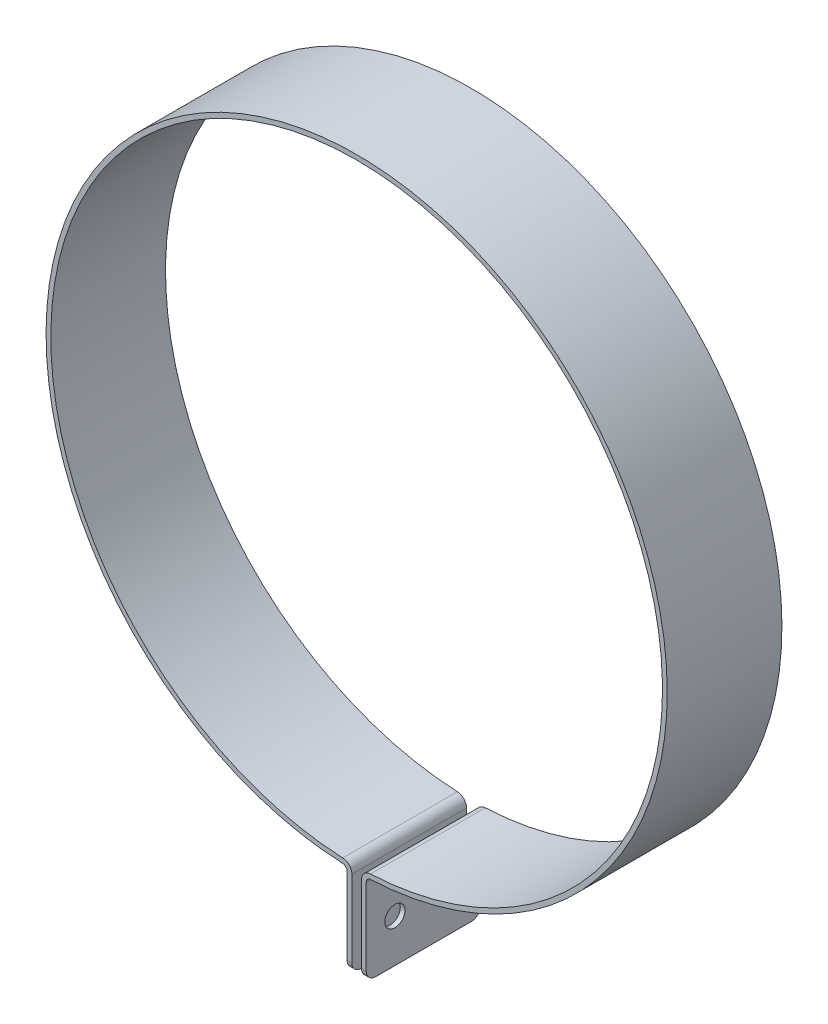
ISO-10303-21;
HEADER;
FILE_DESCRIPTION(('STEP AP214'),'2;1');
FILE_NAME('part.step','',(''),(''),'','','');
FILE_SCHEMA(('AUTOMOTIVE_DESIGN { 1 0 10303 214 1 1 1 1 }'));
ENDSEC;
DATA;
#1=APPLICATION_CONTEXT('core data for automotive mechanical design processes');
#2=APPLICATION_PROTOCOL_DEFINITION('international standard','automotive_design',2000,#1);
#3=PRODUCT_CONTEXT('',#1,'mechanical');
#4=PRODUCT('Part','Part','',(#3));
#5=PRODUCT_RELATED_PRODUCT_CATEGORY('part','',(#4));
#6=PRODUCT_DEFINITION_FORMATION('','',#4);
#7=PRODUCT_DEFINITION_CONTEXT('part definition',#1,'design');
#8=PRODUCT_DEFINITION('design','',#6,#7);
#9=PRODUCT_DEFINITION_SHAPE('','',#8);
#10=(LENGTH_UNIT() NAMED_UNIT(*) SI_UNIT(.MILLI.,.METRE.));
#11=(NAMED_UNIT(*) PLANE_ANGLE_UNIT() SI_UNIT($,.RADIAN.));
#12=(NAMED_UNIT(*) SI_UNIT($,.STERADIAN.) SOLID_ANGLE_UNIT());
#13=UNCERTAINTY_MEASURE_WITH_UNIT(LENGTH_MEASURE(1.E-05),#10,'distance_accuracy_value','');
#14=(GEOMETRIC_REPRESENTATION_CONTEXT(3) GLOBAL_UNCERTAINTY_ASSIGNED_CONTEXT((#13)) GLOBAL_UNIT_ASSIGNED_CONTEXT((#10,
#11,#12)) REPRESENTATION_CONTEXT('',''));
#15=CARTESIAN_POINT('',(0.,0.,0.));
#16=DIRECTION('',(0.,0.,1.));
#17=DIRECTION('',(1.,0.,0.));
#18=AXIS2_PLACEMENT_3D('',#15,#16,#17);
#19=CARTESIAN_POINT('',(-3.175,-133.35,-38.1));
#20=DIRECTION('',(0.,-1.,0.));
#21=DIRECTION('',(0.,0.,-1.));
#22=AXIS2_PLACEMENT_3D('',#19,#20,#21);
#23=PLANE('',#22);
#24=DIRECTION('',(0.,0.,1.));
#25=VECTOR('',#24,1.);
#26=CARTESIAN_POINT('',(-3.175,-133.35,-38.1));
#27=LINE('',#26,#25);
#28=CARTESIAN_POINT('',(-3.175,-133.35,-34.925));
#29=VERTEX_POINT('',#28);
#30=CARTESIAN_POINT('',(-3.175,-133.35,-3.17500000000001));
#31=VERTEX_POINT('',#30);
#32=EDGE_CURVE('E284',#29,#31,#27,.T.);
#33=ORIENTED_EDGE('',*,*,#32,.F.);
#34=DIRECTION('',(1.,0.,0.));
#35=VECTOR('',#34,1.);
#36=CARTESIAN_POINT('',(-1.6002,-133.35,-34.925));
#37=LINE('',#36,#35);
#38=CARTESIAN_POINT('',(-1.6002,-133.35,-34.925));
#39=VERTEX_POINT('',#38);
#40=EDGE_CURVE('E226',#29,#39,#37,.T.);
#41=ORIENTED_EDGE('',*,*,#40,.T.);
#42=DIRECTION('',(0.,0.,-1.));
#43=VECTOR('',#42,1.);
#44=CARTESIAN_POINT('',(-1.6002,-133.35,-38.1));
#45=LINE('',#44,#43);
#46=CARTESIAN_POINT('',(-1.6002,-133.35,-3.175));
#47=VERTEX_POINT('',#46);
#48=EDGE_CURVE('E183',#47,#39,#45,.T.);
#49=ORIENTED_EDGE('',*,*,#48,.F.);
#50=DIRECTION('',(1.,0.,0.));
#51=VECTOR('',#50,1.);
#52=CARTESIAN_POINT('',(-3.175,-133.35,-3.175));
#53=LINE('',#52,#51);
#54=EDGE_CURVE('E224',#47,#31,#53,.F.);
#55=ORIENTED_EDGE('',*,*,#54,.T.);
#56=EDGE_LOOP('',(#33,#41,#49,#55));
#57=FACE_BOUND('',#56,.T.);
#58=ADVANCED_FACE('F37',(#57),#23,.T.);
#59=CARTESIAN_POINT('',(0.,0.,-38.1));
#60=DIRECTION('',(0.,0.,1.));
#61=DIRECTION('',(1.,0.,0.));
#62=AXIS2_PLACEMENT_3D('',#59,#60,#61);
#63=CYLINDRICAL_SURFACE('',#62,103.1748);
#64=CARTESIAN_POINT('',(0.,0.,-38.1));
#65=DIRECTION('',(0.,0.,1.));
#66=DIRECTION('',(1.,0.,0.));
#67=AXIS2_PLACEMENT_3D('',#64,#65,#66);
#68=CIRCLE('',#67,103.1748);
#69=CARTESIAN_POINT('',(4.67839175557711,-103.068676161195,-38.1));
#70=VERTEX_POINT('',#69);
#71=CARTESIAN_POINT('',(-4.67839175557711,-103.068676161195,-38.1));
#72=VERTEX_POINT('',#71);
#73=EDGE_CURVE('E296',#70,#72,#68,.T.);
#74=ORIENTED_EDGE('',*,*,#73,.T.);
#75=DIRECTION('',(0.,0.,1.));
#76=VECTOR('',#75,1.);
#77=CARTESIAN_POINT('',(-4.67839175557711,-103.068676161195,-38.1));
#78=LINE('',#77,#76);
#79=CARTESIAN_POINT('',(-4.67839175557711,-103.068676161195,0.));
#80=VERTEX_POINT('',#79);
#81=EDGE_CURVE('E185',#72,#80,#78,.T.);
#82=ORIENTED_EDGE('',*,*,#81,.T.);
#83=CARTESIAN_POINT('',(0.,0.,0.));
#84=DIRECTION('',(0.,0.,1.));
#85=DIRECTION('',(1.,0.,0.));
#86=AXIS2_PLACEMENT_3D('',#83,#84,#85);
#87=CIRCLE('',#86,103.1748);
#88=CARTESIAN_POINT('',(4.67839175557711,-103.068676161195,0.));
#89=VERTEX_POINT('',#88);
#90=EDGE_CURVE('E162',#89,#80,#87,.T.);
#91=ORIENTED_EDGE('',*,*,#90,.F.);
#92=DIRECTION('',(0.,0.,1.));
#93=VECTOR('',#92,1.);
#94=CARTESIAN_POINT('',(4.67839175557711,-103.068676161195,-38.1));
#95=LINE('',#94,#93);
#96=EDGE_CURVE('E182',#89,#70,#95,.F.);
#97=ORIENTED_EDGE('',*,*,#96,.T.);
#98=EDGE_LOOP('',(#74,#82,#91,#97));
#99=FACE_BOUND('',#98,.T.);
#100=ADVANCED_FACE('F325',(#99),#63,.T.);
#101=CARTESIAN_POINT('',(0.,0.,-38.1));
#102=DIRECTION('',(0.,0.,1.));
#103=DIRECTION('',(1.,0.,0.));
#104=AXIS2_PLACEMENT_3D('',#101,#102,#103);
#105=PLANE('',#104);
#106=DIRECTION('',(0.,1.,0.));
#107=VECTOR('',#106,1.);
#108=CARTESIAN_POINT('',(3.175,-133.35,-38.1));
#109=LINE('',#108,#107);
#110=CARTESIAN_POINT('',(3.175,-130.175,-38.1));
#111=VERTEX_POINT('',#110);
#112=CARTESIAN_POINT('',(3.175,-104.641856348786,-38.1));
#113=VERTEX_POINT('',#112);
#114=EDGE_CURVE('E283',#111,#113,#109,.T.);
#115=ORIENTED_EDGE('',*,*,#114,.F.);
#116=DIRECTION('',(1.,0.,0.));
#117=VECTOR('',#116,1.);
#118=CARTESIAN_POINT('',(1.6002,-130.175,-38.1));
#119=LINE('',#118,#117);
#120=CARTESIAN_POINT('',(1.6002,-130.175,-38.1));
#121=VERTEX_POINT('',#120);
#122=EDGE_CURVE('E216',#111,#121,#119,.F.);
#123=ORIENTED_EDGE('',*,*,#122,.T.);
#124=DIRECTION('',(0.,1.,0.));
#125=VECTOR('',#124,1.);
#126=CARTESIAN_POINT('',(1.6002,-139.7,-38.1));
#127=LINE('',#126,#125);
#128=CARTESIAN_POINT('',(1.6002,-104.666126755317,-38.1));
#129=VERTEX_POINT('',#128);
#130=EDGE_CURVE('E179',#121,#129,#127,.T.);
#131=ORIENTED_EDGE('',*,*,#130,.T.);
#132=CARTESIAN_POINT('',(4.7752,-104.666126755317,-38.1));
#133=DIRECTION('',(0.,0.,1.));
#134=DIRECTION('',(1.,0.,0.));
#135=AXIS2_PLACEMENT_3D('',#132,#133,#134);
#136=CIRCLE('',#135,3.175);
#137=CARTESIAN_POINT('',(4.63049696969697,-101.494425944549,-38.1));
#138=VERTEX_POINT('',#137);
#139=EDGE_CURVE('E210',#129,#138,#136,.F.);
#140=ORIENTED_EDGE('',*,*,#139,.T.);
#141=CARTESIAN_POINT('',(0.,0.,-38.1));
#142=DIRECTION('',(0.,0.,1.));
#143=DIRECTION('',(1.,0.,0.));
#144=AXIS2_PLACEMENT_3D('',#141,#142,#143);
#145=CIRCLE('',#144,101.6);
#146=CARTESIAN_POINT('',(-4.63049696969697,-101.494425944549,-38.1));
#147=VERTEX_POINT('',#146);
#148=EDGE_CURVE('E292',#138,#147,#145,.T.);
#149=ORIENTED_EDGE('',*,*,#148,.T.);
#150=CARTESIAN_POINT('',(-4.7752,-104.666126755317,-38.1));
#151=DIRECTION('',(0.,0.,1.));
#152=DIRECTION('',(1.,0.,0.));
#153=AXIS2_PLACEMENT_3D('',#150,#151,#152);
#154=CIRCLE('',#153,3.175);
#155=CARTESIAN_POINT('',(-1.6002,-104.666126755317,-38.1));
#156=VERTEX_POINT('',#155);
#157=EDGE_CURVE('E212',#147,#156,#154,.F.);
#158=ORIENTED_EDGE('',*,*,#157,.T.);
#159=DIRECTION('',(0.,-1.,0.));
#160=VECTOR('',#159,1.);
#161=CARTESIAN_POINT('',(-1.6002,-139.7,-38.1));
#162=LINE('',#161,#160);
#163=CARTESIAN_POINT('',(-1.6002,-130.175,-38.1));
#164=VERTEX_POINT('',#163);
#165=EDGE_CURVE('E271',#156,#164,#162,.T.);
#166=ORIENTED_EDGE('',*,*,#165,.T.);
#167=DIRECTION('',(1.,0.,0.));
#168=VECTOR('',#167,1.);
#169=CARTESIAN_POINT('',(-3.175,-130.175,-38.1));
#170=LINE('',#169,#168);
#171=CARTESIAN_POINT('',(-3.175,-130.175,-38.1));
#172=VERTEX_POINT('',#171);
#173=EDGE_CURVE('E214',#164,#172,#170,.F.);
#174=ORIENTED_EDGE('',*,*,#173,.T.);
#175=DIRECTION('',(0.,-1.,0.));
#176=VECTOR('',#175,1.);
#177=CARTESIAN_POINT('',(-3.175,-133.35,-38.1));
#178=LINE('',#177,#176);
#179=CARTESIAN_POINT('',(-3.175,-104.641856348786,-38.1));
#180=VERTEX_POINT('',#179);
#181=EDGE_CURVE('E281',#180,#172,#178,.T.);
#182=ORIENTED_EDGE('',*,*,#181,.F.);
#183=CARTESIAN_POINT('',(-4.7498,-104.641856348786,-38.1));
#184=DIRECTION('',(0.,0.,1.));
#185=DIRECTION('',(1.,0.,0.));
#186=AXIS2_PLACEMENT_3D('',#183,#184,#185);
#187=CIRCLE('',#186,1.5748);
#188=EDGE_CURVE('E167',#180,#72,#187,.T.);
#189=ORIENTED_EDGE('',*,*,#188,.T.);
#190=ORIENTED_EDGE('',*,*,#73,.F.);
#191=CARTESIAN_POINT('',(4.7498,-104.641856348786,-38.1));
#192=DIRECTION('',(0.,0.,1.));
#193=DIRECTION('',(1.,0.,0.));
#194=AXIS2_PLACEMENT_3D('',#191,#192,#193);
#195=CIRCLE('',#194,1.5748);
#196=EDGE_CURVE('E198',#70,#113,#195,.T.);
#197=ORIENTED_EDGE('',*,*,#196,.T.);
#198=EDGE_LOOP('',(#115,#123,#131,#140,#149,#158,#166,#174,#182,#189,#190,#197));
#199=FACE_BOUND('',#198,.T.);
#200=ADVANCED_FACE('F328',(#199),#105,.F.);
#201=CARTESIAN_POINT('',(0.,0.,0.));
#202=DIRECTION('',(0.,0.,1.));
#203=DIRECTION('',(1.,0.,0.));
#204=AXIS2_PLACEMENT_3D('',#201,#202,#203);
#205=PLANE('',#204);
#206=DIRECTION('',(0.,-1.,0.));
#207=VECTOR('',#206,1.);
#208=CARTESIAN_POINT('',(-3.175,-133.35,0.));
#209=LINE('',#208,#207);
#210=CARTESIAN_POINT('',(-3.175,-104.641856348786,0.));
#211=VERTEX_POINT('',#210);
#212=CARTESIAN_POINT('',(-3.175,-130.175,0.));
#213=VERTEX_POINT('',#212);
#214=EDGE_CURVE('E159',#211,#213,#209,.T.);
#215=ORIENTED_EDGE('',*,*,#214,.T.);
#216=DIRECTION('',(1.,0.,0.));
#217=VECTOR('',#216,1.);
#218=CARTESIAN_POINT('',(0.,-130.175,0.));
#219=LINE('',#218,#217);
#220=CARTESIAN_POINT('',(-1.6002,-130.175,0.));
#221=VERTEX_POINT('',#220);
#222=EDGE_CURVE('E243',#213,#221,#219,.T.);
#223=ORIENTED_EDGE('',*,*,#222,.T.);
#224=DIRECTION('',(0.,-1.,0.));
#225=VECTOR('',#224,1.);
#226=CARTESIAN_POINT('',(-1.6002,-139.7,0.));
#227=LINE('',#226,#225);
#228=CARTESIAN_POINT('',(-1.6002,-104.666126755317,0.));
#229=VERTEX_POINT('',#228);
#230=EDGE_CURVE('E270',#229,#221,#227,.T.);
#231=ORIENTED_EDGE('',*,*,#230,.F.);
#232=CARTESIAN_POINT('',(-4.7752,-104.666126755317,0.));
#233=DIRECTION('',(0.,0.,1.));
#234=DIRECTION('',(1.,0.,0.));
#235=AXIS2_PLACEMENT_3D('',#232,#233,#234);
#236=CIRCLE('',#235,3.175);
#237=CARTESIAN_POINT('',(-4.63049696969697,-101.494425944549,0.));
#238=VERTEX_POINT('',#237);
#239=EDGE_CURVE('E54',#229,#238,#236,.T.);
#240=ORIENTED_EDGE('',*,*,#239,.T.);
#241=CARTESIAN_POINT('',(0.,0.,0.));
#242=DIRECTION('',(0.,0.,1.));
#243=DIRECTION('',(1.,0.,0.));
#244=AXIS2_PLACEMENT_3D('',#241,#242,#243);
#245=CIRCLE('',#244,101.6);
#246=CARTESIAN_POINT('',(4.63049696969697,-101.494425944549,0.));
#247=VERTEX_POINT('',#246);
#248=EDGE_CURVE('E290',#247,#238,#245,.T.);
#249=ORIENTED_EDGE('',*,*,#248,.F.);
#250=CARTESIAN_POINT('',(4.7752,-104.666126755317,0.));
#251=DIRECTION('',(0.,0.,1.));
#252=DIRECTION('',(1.,0.,0.));
#253=AXIS2_PLACEMENT_3D('',#250,#251,#252);
#254=CIRCLE('',#253,3.175);
#255=CARTESIAN_POINT('',(1.6002,-104.666126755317,0.));
#256=VERTEX_POINT('',#255);
#257=EDGE_CURVE('E62',#247,#256,#254,.T.);
#258=ORIENTED_EDGE('',*,*,#257,.T.);
#259=DIRECTION('',(0.,1.,0.));
#260=VECTOR('',#259,1.);
#261=CARTESIAN_POINT('',(1.6002,-139.7,0.));
#262=LINE('',#261,#260);
#263=CARTESIAN_POINT('',(1.6002,-130.175,0.));
#264=VERTEX_POINT('',#263);
#265=EDGE_CURVE('E274',#264,#256,#262,.T.);
#266=ORIENTED_EDGE('',*,*,#265,.F.);
#267=DIRECTION('',(1.,0.,0.));
#268=VECTOR('',#267,1.);
#269=CARTESIAN_POINT('',(0.,-130.175,0.));
#270=LINE('',#269,#268);
#271=CARTESIAN_POINT('',(3.175,-130.175,0.));
#272=VERTEX_POINT('',#271);
#273=EDGE_CURVE('E240',#264,#272,#270,.T.);
#274=ORIENTED_EDGE('',*,*,#273,.T.);
#275=DIRECTION('',(0.,1.,0.));
#276=VECTOR('',#275,1.);
#277=CARTESIAN_POINT('',(3.175,-133.35,0.));
#278=LINE('',#277,#276);
#279=CARTESIAN_POINT('',(3.175,-104.641856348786,0.));
#280=VERTEX_POINT('',#279);
#281=EDGE_CURVE('E178',#272,#280,#278,.T.);
#282=ORIENTED_EDGE('',*,*,#281,.T.);
#283=CARTESIAN_POINT('',(4.7498,-104.641856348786,0.));
#284=DIRECTION('',(0.,0.,1.));
#285=DIRECTION('',(1.,0.,0.));
#286=AXIS2_PLACEMENT_3D('',#283,#284,#285);
#287=CIRCLE('',#286,1.5748);
#288=EDGE_CURVE('E166',#280,#89,#287,.F.);
#289=ORIENTED_EDGE('',*,*,#288,.T.);
#290=ORIENTED_EDGE('',*,*,#90,.T.);
#291=CARTESIAN_POINT('',(-4.7498,-104.641856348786,0.));
#292=DIRECTION('',(0.,0.,1.));
#293=DIRECTION('',(1.,0.,0.));
#294=AXIS2_PLACEMENT_3D('',#291,#292,#293);
#295=CIRCLE('',#294,1.5748);
#296=EDGE_CURVE('E155',#80,#211,#295,.F.);
#297=ORIENTED_EDGE('',*,*,#296,.T.);
#298=EDGE_LOOP('',(#215,#223,#231,#240,#249,#258,#266,#274,#282,#289,#290,#297));
#299=FACE_BOUND('',#298,.T.);
#300=ADVANCED_FACE('F157',(#299),#205,.T.);
#301=CARTESIAN_POINT('',(0.,0.,-38.1));
#302=DIRECTION('',(0.,0.,1.));
#303=DIRECTION('',(1.,0.,0.));
#304=AXIS2_PLACEMENT_3D('',#301,#302,#303);
#305=CYLINDRICAL_SURFACE('',#304,101.6);
#306=ORIENTED_EDGE('',*,*,#248,.T.);
#307=DIRECTION('',(0.,0.,1.));
#308=VECTOR('',#307,1.);
#309=CARTESIAN_POINT('',(-4.63049696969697,-101.494425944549,-38.1));
#310=LINE('',#309,#308);
#311=EDGE_CURVE('E11',#238,#147,#310,.F.);
#312=ORIENTED_EDGE('',*,*,#311,.T.);
#313=ORIENTED_EDGE('',*,*,#148,.F.);
#314=DIRECTION('',(0.,0.,1.));
#315=VECTOR('',#314,1.);
#316=CARTESIAN_POINT('',(4.63049696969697,-101.494425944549,-38.1));
#317=LINE('',#316,#315);
#318=EDGE_CURVE('E46',#138,#247,#317,.T.);
#319=ORIENTED_EDGE('',*,*,#318,.T.);
#320=EDGE_LOOP('',(#306,#312,#313,#319));
#321=FACE_BOUND('',#320,.T.);
#322=ADVANCED_FACE('F349',(#321),#305,.F.);
#323=CARTESIAN_POINT('',(-3.175,-133.35,-38.1));
#324=DIRECTION('',(-1.,0.,0.));
#325=DIRECTION('',(0.,0.,1.));
#326=AXIS2_PLACEMENT_3D('',#323,#324,#325);
#327=PLANE('',#326);
#328=CARTESIAN_POINT('',(-3.175,-119.0752,-9.525));
#329=DIRECTION('',(-1.,0.,0.));
#330=DIRECTION('',(0.,0.,1.));
#331=AXIS2_PLACEMENT_3D('',#328,#329,#330);
#332=CIRCLE('',#331,3.36549999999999);
#333=CARTESIAN_POINT('',(-3.175,-119.0752,-12.8905));
#334=VERTEX_POINT('',#333);
#335=EDGE_CURVE('E267',#334,#334,#332,.T.);
#336=ORIENTED_EDGE('',*,*,#335,.F.);
#337=EDGE_LOOP('',(#336));
#338=FACE_BOUND('',#337,.T.);
#339=CARTESIAN_POINT('',(-3.175,-119.0752,-28.575));
#340=DIRECTION('',(-1.,0.,0.));
#341=DIRECTION('',(0.,0.,1.));
#342=AXIS2_PLACEMENT_3D('',#339,#340,#341);
#343=CIRCLE('',#342,3.36549999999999);
#344=CARTESIAN_POINT('',(-3.175,-119.0752,-31.9405));
#345=VERTEX_POINT('',#344);
#346=EDGE_CURVE('E252',#345,#345,#343,.T.);
#347=ORIENTED_EDGE('',*,*,#346,.F.);
#348=EDGE_LOOP('',(#347));
#349=FACE_BOUND('',#348,.T.);
#350=ORIENTED_EDGE('',*,*,#181,.T.);
#351=CARTESIAN_POINT('',(-3.175,-130.175,-34.925));
#352=DIRECTION('',(-1.,0.,0.));
#353=DIRECTION('',(0.,0.,1.));
#354=AXIS2_PLACEMENT_3D('',#351,#352,#353);
#355=CIRCLE('',#354,3.175);
#356=EDGE_CURVE('E236',#172,#29,#355,.T.);
#357=ORIENTED_EDGE('',*,*,#356,.T.);
#358=ORIENTED_EDGE('',*,*,#32,.T.);
#359=CARTESIAN_POINT('',(-3.175,-130.175,-3.175));
#360=DIRECTION('',(-1.,0.,0.));
#361=DIRECTION('',(0.,0.,1.));
#362=AXIS2_PLACEMENT_3D('',#359,#360,#361);
#363=CIRCLE('',#362,3.175);
#364=EDGE_CURVE('E177',#31,#213,#363,.T.);
#365=ORIENTED_EDGE('',*,*,#364,.T.);
#366=ORIENTED_EDGE('',*,*,#214,.F.);
#367=DIRECTION('',(0.,0.,-1.));
#368=VECTOR('',#367,1.);
#369=CARTESIAN_POINT('',(-3.175,-104.641856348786,-38.1));
#370=LINE('',#369,#368);
#371=EDGE_CURVE('E173',#211,#180,#370,.T.);
#372=ORIENTED_EDGE('',*,*,#371,.T.);
#373=EDGE_LOOP('',(#350,#357,#358,#365,#366,#372));
#374=FACE_BOUND('',#373,.T.);
#375=ADVANCED_FACE('F172',(#338,#349,#374),#327,.T.);
#376=CARTESIAN_POINT('',(3.175,-133.35,-38.1));
#377=DIRECTION('',(1.,0.,0.));
#378=DIRECTION('',(0.,0.,-1.));
#379=AXIS2_PLACEMENT_3D('',#376,#377,#378);
#380=PLANE('',#379);
#381=CARTESIAN_POINT('',(3.175,-119.0752,-9.525));
#382=DIRECTION('',(1.,0.,0.));
#383=DIRECTION('',(0.,0.,-1.));
#384=AXIS2_PLACEMENT_3D('',#381,#382,#383);
#385=CIRCLE('',#384,3.36549999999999);
#386=CARTESIAN_POINT('',(3.175,-119.0752,-12.8905));
#387=VERTEX_POINT('',#386);
#388=EDGE_CURVE('E248',#387,#387,#385,.T.);
#389=ORIENTED_EDGE('',*,*,#388,.F.);
#390=EDGE_LOOP('',(#389));
#391=FACE_BOUND('',#390,.T.);
#392=CARTESIAN_POINT('',(3.175,-119.0752,-28.575));
#393=DIRECTION('',(1.,0.,0.));
#394=DIRECTION('',(0.,0.,-1.));
#395=AXIS2_PLACEMENT_3D('',#392,#393,#394);
#396=CIRCLE('',#395,3.36549999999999);
#397=CARTESIAN_POINT('',(3.175,-119.0752,-31.9405));
#398=VERTEX_POINT('',#397);
#399=EDGE_CURVE('E255',#398,#398,#396,.T.);
#400=ORIENTED_EDGE('',*,*,#399,.F.);
#401=EDGE_LOOP('',(#400));
#402=FACE_BOUND('',#401,.T.);
#403=DIRECTION('',(0.,0.,1.));
#404=VECTOR('',#403,1.);
#405=CARTESIAN_POINT('',(3.175,-133.35,-38.1));
#406=LINE('',#405,#404);
#407=CARTESIAN_POINT('',(3.175,-133.35,-34.925));
#408=VERTEX_POINT('',#407);
#409=CARTESIAN_POINT('',(3.175,-133.35,-3.17500000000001));
#410=VERTEX_POINT('',#409);
#411=EDGE_CURVE('E287',#408,#410,#406,.T.);
#412=ORIENTED_EDGE('',*,*,#411,.F.);
#413=CARTESIAN_POINT('',(3.175,-130.175,-34.925));
#414=DIRECTION('',(1.,0.,0.));
#415=DIRECTION('',(0.,0.,-1.));
#416=AXIS2_PLACEMENT_3D('',#413,#414,#415);
#417=CIRCLE('',#416,3.175);
#418=EDGE_CURVE('E208',#408,#111,#417,.T.);
#419=ORIENTED_EDGE('',*,*,#418,.T.);
#420=ORIENTED_EDGE('',*,*,#114,.T.);
#421=DIRECTION('',(0.,0.,-1.));
#422=VECTOR('',#421,1.);
#423=CARTESIAN_POINT('',(3.175,-104.641856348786,0.));
#424=LINE('',#423,#422);
#425=EDGE_CURVE('E193',#113,#280,#424,.F.);
#426=ORIENTED_EDGE('',*,*,#425,.T.);
#427=ORIENTED_EDGE('',*,*,#281,.F.);
#428=CARTESIAN_POINT('',(3.175,-130.175,-3.175));
#429=DIRECTION('',(1.,0.,0.));
#430=DIRECTION('',(0.,0.,-1.));
#431=AXIS2_PLACEMENT_3D('',#428,#429,#430);
#432=CIRCLE('',#431,3.175);
#433=EDGE_CURVE('E206',#272,#410,#432,.T.);
#434=ORIENTED_EDGE('',*,*,#433,.T.);
#435=EDGE_LOOP('',(#412,#419,#420,#426,#427,#434));
#436=FACE_BOUND('',#435,.T.);
#437=ADVANCED_FACE('F317',(#391,#402,#436),#380,.T.);
#438=DIRECTION('',(0.,0.,1.));
#439=VECTOR('',#438,1.);
#440=CARTESIAN_POINT('',(1.6002,-133.35,-38.1));
#441=LINE('',#440,#439);
#442=CARTESIAN_POINT('',(1.6002,-133.35,-34.925));
#443=VERTEX_POINT('',#442);
#444=CARTESIAN_POINT('',(1.6002,-133.35,-3.175));
#445=VERTEX_POINT('',#444);
#446=EDGE_CURVE('E188',#443,#445,#441,.T.);
#447=ORIENTED_EDGE('',*,*,#446,.F.);
#448=DIRECTION('',(1.,0.,0.));
#449=VECTOR('',#448,1.);
#450=CARTESIAN_POINT('',(3.175,-133.35,-34.925));
#451=LINE('',#450,#449);
#452=EDGE_CURVE('E203',#443,#408,#451,.T.);
#453=ORIENTED_EDGE('',*,*,#452,.T.);
#454=ORIENTED_EDGE('',*,*,#411,.T.);
#455=DIRECTION('',(1.,0.,0.));
#456=VECTOR('',#455,1.);
#457=CARTESIAN_POINT('',(-3.175,-133.35,-3.175));
#458=LINE('',#457,#456);
#459=EDGE_CURVE('E201',#410,#445,#458,.F.);
#460=ORIENTED_EDGE('',*,*,#459,.T.);
#461=EDGE_LOOP('',(#447,#453,#454,#460));
#462=FACE_BOUND('',#461,.T.);
#463=ADVANCED_FACE('F354',(#462),#23,.T.);
#464=CARTESIAN_POINT('',(1.6002,-139.7,-38.1));
#465=DIRECTION('',(1.,0.,0.));
#466=DIRECTION('',(0.,0.,-1.));
#467=AXIS2_PLACEMENT_3D('',#464,#465,#466);
#468=PLANE('',#467);
#469=CARTESIAN_POINT('',(1.6002,-119.0752,-9.525));
#470=DIRECTION('',(1.,0.,0.));
#471=DIRECTION('',(0.,0.,-1.));
#472=AXIS2_PLACEMENT_3D('',#469,#470,#471);
#473=CIRCLE('',#472,3.36549999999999);
#474=CARTESIAN_POINT('',(1.6002,-119.0752,-12.8905));
#475=VERTEX_POINT('',#474);
#476=EDGE_CURVE('E264',#475,#475,#473,.T.);
#477=ORIENTED_EDGE('',*,*,#476,.T.);
#478=EDGE_LOOP('',(#477));
#479=FACE_BOUND('',#478,.T.);
#480=CARTESIAN_POINT('',(1.6002,-119.0752,-28.575));
#481=DIRECTION('',(1.,0.,0.));
#482=DIRECTION('',(0.,0.,-1.));
#483=AXIS2_PLACEMENT_3D('',#480,#481,#482);
#484=CIRCLE('',#483,3.36549999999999);
#485=CARTESIAN_POINT('',(1.6002,-119.0752,-31.9405));
#486=VERTEX_POINT('',#485);
#487=EDGE_CURVE('E247',#486,#486,#484,.T.);
#488=ORIENTED_EDGE('',*,*,#487,.T.);
#489=EDGE_LOOP('',(#488));
#490=FACE_BOUND('',#489,.T.);
#491=ORIENTED_EDGE('',*,*,#130,.F.);
#492=CARTESIAN_POINT('',(1.6002,-130.175,-34.925));
#493=DIRECTION('',(1.,0.,0.));
#494=DIRECTION('',(0.,0.,-1.));
#495=AXIS2_PLACEMENT_3D('',#492,#493,#494);
#496=CIRCLE('',#495,3.175);
#497=EDGE_CURVE('E222',#121,#443,#496,.F.);
#498=ORIENTED_EDGE('',*,*,#497,.T.);
#499=ORIENTED_EDGE('',*,*,#446,.T.);
#500=CARTESIAN_POINT('',(1.6002,-130.175,-3.175));
#501=DIRECTION('',(1.,0.,0.));
#502=DIRECTION('',(0.,0.,-1.));
#503=AXIS2_PLACEMENT_3D('',#500,#501,#502);
#504=CIRCLE('',#503,3.175);
#505=EDGE_CURVE('E220',#445,#264,#504,.F.);
#506=ORIENTED_EDGE('',*,*,#505,.T.);
#507=ORIENTED_EDGE('',*,*,#265,.T.);
#508=DIRECTION('',(0.,0.,1.));
#509=VECTOR('',#508,1.);
#510=CARTESIAN_POINT('',(1.6002,-104.666126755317,-38.1));
#511=LINE('',#510,#509);
#512=EDGE_CURVE('E218',#256,#129,#511,.F.);
#513=ORIENTED_EDGE('',*,*,#512,.T.);
#514=EDGE_LOOP('',(#491,#498,#499,#506,#507,#513));
#515=FACE_BOUND('',#514,.T.);
#516=ADVANCED_FACE('F304',(#479,#490,#515),#468,.F.);
#517=CARTESIAN_POINT('',(-1.6002,-139.7,-38.1));
#518=DIRECTION('',(-1.,0.,0.));
#519=DIRECTION('',(0.,0.,1.));
#520=AXIS2_PLACEMENT_3D('',#517,#518,#519);
#521=PLANE('',#520);
#522=CARTESIAN_POINT('',(-1.6002,-119.0752,-9.525));
#523=DIRECTION('',(-1.,0.,0.));
#524=DIRECTION('',(0.,0.,1.));
#525=AXIS2_PLACEMENT_3D('',#522,#523,#524);
#526=CIRCLE('',#525,3.36549999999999);
#527=CARTESIAN_POINT('',(-1.60019999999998,-119.0752,-12.8905));
#528=VERTEX_POINT('',#527);
#529=EDGE_CURVE('E41',#528,#528,#526,.T.);
#530=ORIENTED_EDGE('',*,*,#529,.T.);
#531=EDGE_LOOP('',(#530));
#532=FACE_BOUND('',#531,.T.);
#533=CARTESIAN_POINT('',(-1.6002,-119.0752,-28.575));
#534=DIRECTION('',(-1.,0.,0.));
#535=DIRECTION('',(0.,0.,1.));
#536=AXIS2_PLACEMENT_3D('',#533,#534,#535);
#537=CIRCLE('',#536,3.36549999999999);
#538=CARTESIAN_POINT('',(-1.60019999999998,-119.0752,-31.9405));
#539=VERTEX_POINT('',#538);
#540=EDGE_CURVE('E245',#539,#539,#537,.T.);
#541=ORIENTED_EDGE('',*,*,#540,.T.);
#542=EDGE_LOOP('',(#541));
#543=FACE_BOUND('',#542,.T.);
#544=ORIENTED_EDGE('',*,*,#48,.T.);
#545=CARTESIAN_POINT('',(-1.6002,-130.175,-34.925));
#546=DIRECTION('',(-1.,0.,0.));
#547=DIRECTION('',(0.,0.,1.));
#548=AXIS2_PLACEMENT_3D('',#545,#546,#547);
#549=CIRCLE('',#548,3.175);
#550=EDGE_CURVE('E233',#39,#164,#549,.F.);
#551=ORIENTED_EDGE('',*,*,#550,.T.);
#552=ORIENTED_EDGE('',*,*,#165,.F.);
#553=DIRECTION('',(0.,0.,1.));
#554=VECTOR('',#553,1.);
#555=CARTESIAN_POINT('',(-1.6002,-104.666126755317,-38.1));
#556=LINE('',#555,#554);
#557=EDGE_CURVE('E229',#156,#229,#556,.T.);
#558=ORIENTED_EDGE('',*,*,#557,.T.);
#559=ORIENTED_EDGE('',*,*,#230,.T.);
#560=CARTESIAN_POINT('',(-1.6002,-130.175,-3.175));
#561=DIRECTION('',(-1.,0.,0.));
#562=DIRECTION('',(0.,0.,1.));
#563=AXIS2_PLACEMENT_3D('',#560,#561,#562);
#564=CIRCLE('',#563,3.175);
#565=EDGE_CURVE('E231',#221,#47,#564,.F.);
#566=ORIENTED_EDGE('',*,*,#565,.T.);
#567=EDGE_LOOP('',(#544,#551,#552,#558,#559,#566));
#568=FACE_BOUND('',#567,.T.);
#569=ADVANCED_FACE('F339',(#532,#543,#568),#521,.F.);
#570=CARTESIAN_POINT('',(-4.7498,-104.641856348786,-38.1));
#571=DIRECTION('',(0.,0.,1.));
#572=DIRECTION('',(1.,0.,0.));
#573=AXIS2_PLACEMENT_3D('',#570,#571,#572);
#574=CYLINDRICAL_SURFACE('',#573,1.5748);
#575=ORIENTED_EDGE('',*,*,#296,.F.);
#576=ORIENTED_EDGE('',*,*,#81,.F.);
#577=ORIENTED_EDGE('',*,*,#188,.F.);
#578=ORIENTED_EDGE('',*,*,#371,.F.);
#579=EDGE_LOOP('',(#575,#576,#577,#578));
#580=FACE_BOUND('',#579,.T.);
#581=ADVANCED_FACE('F181',(#580),#574,.F.);
#582=CARTESIAN_POINT('',(4.7498,-104.641856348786,-38.1));
#583=DIRECTION('',(0.,0.,1.));
#584=DIRECTION('',(1.,0.,0.));
#585=AXIS2_PLACEMENT_3D('',#582,#583,#584);
#586=CYLINDRICAL_SURFACE('',#585,1.5748);
#587=ORIENTED_EDGE('',*,*,#196,.F.);
#588=ORIENTED_EDGE('',*,*,#96,.F.);
#589=ORIENTED_EDGE('',*,*,#288,.F.);
#590=ORIENTED_EDGE('',*,*,#425,.F.);
#591=EDGE_LOOP('',(#587,#588,#589,#590));
#592=FACE_BOUND('',#591,.T.);
#593=ADVANCED_FACE('F322',(#592),#586,.F.);
#594=CARTESIAN_POINT('',(-3.175,-130.175,-34.925));
#595=DIRECTION('',(-1.,0.,0.));
#596=DIRECTION('',(0.,0.,1.));
#597=AXIS2_PLACEMENT_3D('',#594,#595,#596);
#598=CYLINDRICAL_SURFACE('',#597,3.175);
#599=ORIENTED_EDGE('',*,*,#497,.F.);
#600=ORIENTED_EDGE('',*,*,#122,.F.);
#601=ORIENTED_EDGE('',*,*,#418,.F.);
#602=ORIENTED_EDGE('',*,*,#452,.F.);
#603=EDGE_LOOP('',(#599,#600,#601,#602));
#604=FACE_BOUND('',#603,.T.);
#605=ADVANCED_FACE('F353',(#604),#598,.T.);
#606=CARTESIAN_POINT('',(-3.175,-130.175,-34.925));
#607=DIRECTION('',(-1.,0.,0.));
#608=DIRECTION('',(0.,0.,1.));
#609=AXIS2_PLACEMENT_3D('',#606,#607,#608);
#610=CYLINDRICAL_SURFACE('',#609,3.175);
#611=ORIENTED_EDGE('',*,*,#356,.F.);
#612=ORIENTED_EDGE('',*,*,#173,.F.);
#613=ORIENTED_EDGE('',*,*,#550,.F.);
#614=ORIENTED_EDGE('',*,*,#40,.F.);
#615=EDGE_LOOP('',(#611,#612,#613,#614));
#616=FACE_BOUND('',#615,.T.);
#617=ADVANCED_FACE('F334',(#616),#610,.T.);
#618=CARTESIAN_POINT('',(0.,-130.175,-3.175));
#619=DIRECTION('',(1.,0.,0.));
#620=DIRECTION('',(0.,0.,-1.));
#621=AXIS2_PLACEMENT_3D('',#618,#619,#620);
#622=CYLINDRICAL_SURFACE('',#621,3.175);
#623=ORIENTED_EDGE('',*,*,#364,.F.);
#624=ORIENTED_EDGE('',*,*,#54,.F.);
#625=ORIENTED_EDGE('',*,*,#565,.F.);
#626=ORIENTED_EDGE('',*,*,#222,.F.);
#627=EDGE_LOOP('',(#623,#624,#625,#626));
#628=FACE_BOUND('',#627,.T.);
#629=ADVANCED_FACE('F342',(#628),#622,.T.);
#630=CARTESIAN_POINT('',(0.,-130.175,-3.175));
#631=DIRECTION('',(1.,0.,0.));
#632=DIRECTION('',(0.,0.,-1.));
#633=AXIS2_PLACEMENT_3D('',#630,#631,#632);
#634=CYLINDRICAL_SURFACE('',#633,3.175);
#635=ORIENTED_EDGE('',*,*,#505,.F.);
#636=ORIENTED_EDGE('',*,*,#459,.F.);
#637=ORIENTED_EDGE('',*,*,#433,.F.);
#638=ORIENTED_EDGE('',*,*,#273,.F.);
#639=EDGE_LOOP('',(#635,#636,#637,#638));
#640=FACE_BOUND('',#639,.T.);
#641=ADVANCED_FACE('F312',(#640),#634,.T.);
#642=CARTESIAN_POINT('',(-4.7752,-104.666126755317,-38.1));
#643=DIRECTION('',(0.,0.,1.));
#644=DIRECTION('',(1.,0.,0.));
#645=AXIS2_PLACEMENT_3D('',#642,#643,#644);
#646=CYLINDRICAL_SURFACE('',#645,3.175);
#647=ORIENTED_EDGE('',*,*,#239,.F.);
#648=ORIENTED_EDGE('',*,*,#557,.F.);
#649=ORIENTED_EDGE('',*,*,#157,.F.);
#650=ORIENTED_EDGE('',*,*,#311,.F.);
#651=EDGE_LOOP('',(#647,#648,#649,#650));
#652=FACE_BOUND('',#651,.T.);
#653=ADVANCED_FACE('F346',(#652),#646,.T.);
#654=CARTESIAN_POINT('',(4.7752,-104.666126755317,-38.1));
#655=DIRECTION('',(0.,0.,1.));
#656=DIRECTION('',(1.,0.,0.));
#657=AXIS2_PLACEMENT_3D('',#654,#655,#656);
#658=CYLINDRICAL_SURFACE('',#657,3.175);
#659=ORIENTED_EDGE('',*,*,#139,.F.);
#660=ORIENTED_EDGE('',*,*,#512,.F.);
#661=ORIENTED_EDGE('',*,*,#257,.F.);
#662=ORIENTED_EDGE('',*,*,#318,.F.);
#663=EDGE_LOOP('',(#659,#660,#661,#662));
#664=FACE_BOUND('',#663,.T.);
#665=ADVANCED_FACE('F39',(#664),#658,.T.);
#666=CARTESIAN_POINT('',(-103.1748,-119.0752,-28.575));
#667=DIRECTION('',(1.,0.,0.));
#668=DIRECTION('',(0.,0.,-1.));
#669=AXIS2_PLACEMENT_3D('',#666,#667,#668);
#670=CYLINDRICAL_SURFACE('',#669,3.36549999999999);
#671=CARTESIAN_POINT('',(-3.175,-119.0752,-31.9405));
#672=CARTESIAN_POINT('',(-3.15859583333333,-119.0752,-31.9405));
#673=CARTESIAN_POINT('',(-3.14219166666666,-119.0752,-31.9405));
#674=CARTESIAN_POINT('',(-3.10938333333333,-119.0752,-31.9405));
#675=CARTESIAN_POINT('',(-3.09297916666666,-119.0752,-31.9405));
#676=CARTESIAN_POINT('',(-3.06017083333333,-119.0752,-31.9405));
#677=CARTESIAN_POINT('',(-3.04376666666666,-119.0752,-31.9405));
#678=CARTESIAN_POINT('',(-3.01095833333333,-119.0752,-31.9405));
#679=CARTESIAN_POINT('',(-2.99455416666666,-119.0752,-31.9405));
#680=CARTESIAN_POINT('',(-2.96174583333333,-119.0752,-31.9405));
#681=CARTESIAN_POINT('',(-2.94534166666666,-119.0752,-31.9405));
#682=CARTESIAN_POINT('',(-2.91253333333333,-119.0752,-31.9405));
#683=CARTESIAN_POINT('',(-2.89612916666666,-119.0752,-31.9405));
#684=CARTESIAN_POINT('',(-2.86332083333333,-119.0752,-31.9405));
#685=CARTESIAN_POINT('',(-2.84691666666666,-119.0752,-31.9405));
#686=CARTESIAN_POINT('',(-2.81410833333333,-119.0752,-31.9405));
#687=CARTESIAN_POINT('',(-2.79770416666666,-119.0752,-31.9405));
#688=CARTESIAN_POINT('',(-2.76489583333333,-119.0752,-31.9405));
#689=CARTESIAN_POINT('',(-2.74849166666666,-119.0752,-31.9405));
#690=CARTESIAN_POINT('',(-2.71568333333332,-119.0752,-31.9405));
#691=CARTESIAN_POINT('',(-2.69927916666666,-119.0752,-31.9405));
#692=CARTESIAN_POINT('',(-2.66647083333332,-119.0752,-31.9405));
#693=CARTESIAN_POINT('',(-2.65006666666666,-119.0752,-31.9405));
#694=CARTESIAN_POINT('',(-2.61725833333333,-119.0752,-31.9405));
#695=CARTESIAN_POINT('',(-2.60085416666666,-119.0752,-31.9405));
#696=CARTESIAN_POINT('',(-2.56804583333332,-119.0752,-31.9405));
#697=CARTESIAN_POINT('',(-2.55164166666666,-119.0752,-31.9405));
#698=CARTESIAN_POINT('',(-2.51883333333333,-119.0752,-31.9405));
#699=CARTESIAN_POINT('',(-2.50242916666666,-119.0752,-31.9405));
#700=CARTESIAN_POINT('',(-2.46962083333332,-119.0752,-31.9405));
#701=CARTESIAN_POINT('',(-2.45321666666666,-119.0752,-31.9405));
#702=CARTESIAN_POINT('',(-2.42040833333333,-119.0752,-31.9405));
#703=CARTESIAN_POINT('',(-2.40400416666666,-119.0752,-31.9405));
#704=CARTESIAN_POINT('',(-2.37119583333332,-119.0752,-31.9405));
#705=CARTESIAN_POINT('',(-2.35479166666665,-119.0752,-31.9405));
#706=CARTESIAN_POINT('',(-2.32198333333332,-119.0752,-31.9405));
#707=CARTESIAN_POINT('',(-2.30557916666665,-119.0752,-31.9405));
#708=CARTESIAN_POINT('',(-2.27277083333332,-119.0752,-31.9405));
#709=CARTESIAN_POINT('',(-2.25636666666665,-119.0752,-31.9405));
#710=CARTESIAN_POINT('',(-2.22355833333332,-119.0752,-31.9405));
#711=CARTESIAN_POINT('',(-2.20715416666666,-119.0752,-31.9405));
#712=CARTESIAN_POINT('',(-2.17434583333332,-119.0752,-31.9405));
#713=CARTESIAN_POINT('',(-2.15794166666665,-119.0752,-31.9405));
#714=CARTESIAN_POINT('',(-2.12513333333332,-119.0752,-31.9405));
#715=CARTESIAN_POINT('',(-2.10872916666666,-119.0752,-31.9405));
#716=CARTESIAN_POINT('',(-2.07592083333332,-119.0752,-31.9405));
#717=CARTESIAN_POINT('',(-2.05951666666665,-119.0752,-31.9405));
#718=CARTESIAN_POINT('',(-2.02670833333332,-119.0752,-31.9405));
#719=CARTESIAN_POINT('',(-2.01030416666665,-119.0752,-31.9405));
#720=CARTESIAN_POINT('',(-1.97749583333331,-119.0752,-31.9405));
#721=CARTESIAN_POINT('',(-1.96109166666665,-119.0752,-31.9405));
#722=CARTESIAN_POINT('',(-1.92828333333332,-119.0752,-31.9405));
#723=CARTESIAN_POINT('',(-1.91187916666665,-119.0752,-31.9405));
#724=CARTESIAN_POINT('',(-1.87907083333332,-119.0752,-31.9405));
#725=CARTESIAN_POINT('',(-1.86266666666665,-119.0752,-31.9405));
#726=CARTESIAN_POINT('',(-1.82985833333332,-119.0752,-31.9405));
#727=CARTESIAN_POINT('',(-1.81345416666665,-119.0752,-31.9405));
#728=CARTESIAN_POINT('',(-1.78064583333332,-119.0752,-31.9405));
#729=CARTESIAN_POINT('',(-1.76424166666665,-119.0752,-31.9405));
#730=CARTESIAN_POINT('',(-1.73143333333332,-119.0752,-31.9405));
#731=CARTESIAN_POINT('',(-1.71502916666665,-119.0752,-31.9405));
#732=CARTESIAN_POINT('',(-1.68222083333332,-119.0752,-31.9405));
#733=CARTESIAN_POINT('',(-1.66581666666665,-119.0752,-31.9405));
#734=CARTESIAN_POINT('',(-1.63300833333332,-119.0752,-31.9405));
#735=CARTESIAN_POINT('',(-1.61660416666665,-119.0752,-31.9405));
#736=CARTESIAN_POINT('',(-1.60019999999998,-119.0752,-31.9405));
#737=B_SPLINE_CURVE_WITH_KNOTS('',3,(#671,#672,#673,#674,#675,#676,#677,#678,#679,#680,#681,
#682,#683,#684,#685,#686,#687,#688,#689,#690,#691,#692,#693,#694,#695,#696,#697,#698,#699,#700,
#701,#702,#703,#704,#705,#706,#707,#708,#709,#710,#711,#712,#713,#714,#715,#716,#717,#718,#719,
#720,#721,#722,#723,#724,#725,#726,#727,#728,#729,#730,#731,#732,#733,#734,#735,#736),
.UNSPECIFIED.,.F.,.F.,(4,2,2,2,2,2,2,2,2,2,2,2,2,2,2,2,2,2,2,2,2,2,2,2,2,2,2,2,2,2,2,2,4),(0.,
0.0492125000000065,0.0984249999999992,0.147637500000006,0.196849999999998,0.246062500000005,
0.295274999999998,0.344487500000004,0.393699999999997,0.442912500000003,0.49212500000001,
0.541337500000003,0.590550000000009,0.639762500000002,0.688975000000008,0.738187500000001,
0.787400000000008,0.836612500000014,0.885825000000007,0.935037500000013,0.984250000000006,
1.03346250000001,1.08267500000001,1.13188750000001,1.18110000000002,1.23031250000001,
1.27952500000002,1.32873750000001,1.37795000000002,1.42716250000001,1.47637500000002,
1.52558750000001,1.57480000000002),.UNSPECIFIED.);
#738=EDGE_CURVE('BSEAM392',#345,#539,#737,.T.);
#739=ORIENTED_EDGE('',*,*,#346,.T.);
#740=ORIENTED_EDGE('',*,*,#540,.F.);
#741=ORIENTED_EDGE('',*,*,#738,.T.);
#742=ORIENTED_EDGE('',*,*,#738,.F.);
#743=EDGE_LOOP('',(#739,#741,#740,#742));
#744=FACE_BOUND('',#743,.T.);
#745=ADVANCED_FACE('F392',(#744),#670,.F.);
#746=CARTESIAN_POINT('',(-103.1748,-119.0752,-9.525));
#747=DIRECTION('',(1.,0.,0.));
#748=DIRECTION('',(0.,0.,-1.));
#749=AXIS2_PLACEMENT_3D('',#746,#747,#748);
#750=CYLINDRICAL_SURFACE('',#749,3.36549999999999);
#751=CARTESIAN_POINT('',(-3.175,-119.0752,-12.8905));
#752=CARTESIAN_POINT('',(-3.15859583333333,-119.0752,-12.8905));
#753=CARTESIAN_POINT('',(-3.14219166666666,-119.0752,-12.8905));
#754=CARTESIAN_POINT('',(-3.10938333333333,-119.0752,-12.8905));
#755=CARTESIAN_POINT('',(-3.09297916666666,-119.0752,-12.8905));
#756=CARTESIAN_POINT('',(-3.06017083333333,-119.0752,-12.8905));
#757=CARTESIAN_POINT('',(-3.04376666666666,-119.0752,-12.8905));
#758=CARTESIAN_POINT('',(-3.01095833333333,-119.0752,-12.8905));
#759=CARTESIAN_POINT('',(-2.99455416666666,-119.0752,-12.8905));
#760=CARTESIAN_POINT('',(-2.96174583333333,-119.0752,-12.8905));
#761=CARTESIAN_POINT('',(-2.94534166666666,-119.0752,-12.8905));
#762=CARTESIAN_POINT('',(-2.91253333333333,-119.0752,-12.8905));
#763=CARTESIAN_POINT('',(-2.89612916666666,-119.0752,-12.8905));
#764=CARTESIAN_POINT('',(-2.86332083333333,-119.0752,-12.8905));
#765=CARTESIAN_POINT('',(-2.84691666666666,-119.0752,-12.8905));
#766=CARTESIAN_POINT('',(-2.81410833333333,-119.0752,-12.8905));
#767=CARTESIAN_POINT('',(-2.79770416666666,-119.0752,-12.8905));
#768=CARTESIAN_POINT('',(-2.76489583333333,-119.0752,-12.8905));
#769=CARTESIAN_POINT('',(-2.74849166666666,-119.0752,-12.8905));
#770=CARTESIAN_POINT('',(-2.71568333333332,-119.0752,-12.8905));
#771=CARTESIAN_POINT('',(-2.69927916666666,-119.0752,-12.8905));
#772=CARTESIAN_POINT('',(-2.66647083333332,-119.0752,-12.8905));
#773=CARTESIAN_POINT('',(-2.65006666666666,-119.0752,-12.8905));
#774=CARTESIAN_POINT('',(-2.61725833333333,-119.0752,-12.8905));
#775=CARTESIAN_POINT('',(-2.60085416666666,-119.0752,-12.8905));
#776=CARTESIAN_POINT('',(-2.56804583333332,-119.0752,-12.8905));
#777=CARTESIAN_POINT('',(-2.55164166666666,-119.0752,-12.8905));
#778=CARTESIAN_POINT('',(-2.51883333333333,-119.0752,-12.8905));
#779=CARTESIAN_POINT('',(-2.50242916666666,-119.0752,-12.8905));
#780=CARTESIAN_POINT('',(-2.46962083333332,-119.0752,-12.8905));
#781=CARTESIAN_POINT('',(-2.45321666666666,-119.0752,-12.8905));
#782=CARTESIAN_POINT('',(-2.42040833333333,-119.0752,-12.8905));
#783=CARTESIAN_POINT('',(-2.40400416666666,-119.0752,-12.8905));
#784=CARTESIAN_POINT('',(-2.37119583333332,-119.0752,-12.8905));
#785=CARTESIAN_POINT('',(-2.35479166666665,-119.0752,-12.8905));
#786=CARTESIAN_POINT('',(-2.32198333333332,-119.0752,-12.8905));
#787=CARTESIAN_POINT('',(-2.30557916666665,-119.0752,-12.8905));
#788=CARTESIAN_POINT('',(-2.27277083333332,-119.0752,-12.8905));
#789=CARTESIAN_POINT('',(-2.25636666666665,-119.0752,-12.8905));
#790=CARTESIAN_POINT('',(-2.22355833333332,-119.0752,-12.8905));
#791=CARTESIAN_POINT('',(-2.20715416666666,-119.0752,-12.8905));
#792=CARTESIAN_POINT('',(-2.17434583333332,-119.0752,-12.8905));
#793=CARTESIAN_POINT('',(-2.15794166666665,-119.0752,-12.8905));
#794=CARTESIAN_POINT('',(-2.12513333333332,-119.0752,-12.8905));
#795=CARTESIAN_POINT('',(-2.10872916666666,-119.0752,-12.8905));
#796=CARTESIAN_POINT('',(-2.07592083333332,-119.0752,-12.8905));
#797=CARTESIAN_POINT('',(-2.05951666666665,-119.0752,-12.8905));
#798=CARTESIAN_POINT('',(-2.02670833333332,-119.0752,-12.8905));
#799=CARTESIAN_POINT('',(-2.01030416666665,-119.0752,-12.8905));
#800=CARTESIAN_POINT('',(-1.97749583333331,-119.0752,-12.8905));
#801=CARTESIAN_POINT('',(-1.96109166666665,-119.0752,-12.8905));
#802=CARTESIAN_POINT('',(-1.92828333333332,-119.0752,-12.8905));
#803=CARTESIAN_POINT('',(-1.91187916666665,-119.0752,-12.8905));
#804=CARTESIAN_POINT('',(-1.87907083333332,-119.0752,-12.8905));
#805=CARTESIAN_POINT('',(-1.86266666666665,-119.0752,-12.8905));
#806=CARTESIAN_POINT('',(-1.82985833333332,-119.0752,-12.8905));
#807=CARTESIAN_POINT('',(-1.81345416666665,-119.0752,-12.8905));
#808=CARTESIAN_POINT('',(-1.78064583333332,-119.0752,-12.8905));
#809=CARTESIAN_POINT('',(-1.76424166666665,-119.0752,-12.8905));
#810=CARTESIAN_POINT('',(-1.73143333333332,-119.0752,-12.8905));
#811=CARTESIAN_POINT('',(-1.71502916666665,-119.0752,-12.8905));
#812=CARTESIAN_POINT('',(-1.68222083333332,-119.0752,-12.8905));
#813=CARTESIAN_POINT('',(-1.66581666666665,-119.0752,-12.8905));
#814=CARTESIAN_POINT('',(-1.63300833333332,-119.0752,-12.8905));
#815=CARTESIAN_POINT('',(-1.61660416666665,-119.0752,-12.8905));
#816=CARTESIAN_POINT('',(-1.60019999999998,-119.0752,-12.8905));
#817=B_SPLINE_CURVE_WITH_KNOTS('',3,(#751,#752,#753,#754,#755,#756,#757,#758,#759,#760,#761,
#762,#763,#764,#765,#766,#767,#768,#769,#770,#771,#772,#773,#774,#775,#776,#777,#778,#779,#780,
#781,#782,#783,#784,#785,#786,#787,#788,#789,#790,#791,#792,#793,#794,#795,#796,#797,#798,#799,
#800,#801,#802,#803,#804,#805,#806,#807,#808,#809,#810,#811,#812,#813,#814,#815,#816),
.UNSPECIFIED.,.F.,.F.,(4,2,2,2,2,2,2,2,2,2,2,2,2,2,2,2,2,2,2,2,2,2,2,2,2,2,2,2,2,2,2,2,4),(0.,
0.0492125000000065,0.0984249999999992,0.147637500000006,0.196849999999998,0.246062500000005,
0.295274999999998,0.344487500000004,0.393699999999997,0.442912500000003,0.49212500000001,
0.541337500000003,0.590550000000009,0.639762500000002,0.688975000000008,0.738187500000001,
0.787400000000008,0.836612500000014,0.885825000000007,0.935037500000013,0.984250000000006,
1.03346250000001,1.08267500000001,1.13188750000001,1.18110000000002,1.23031250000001,
1.27952500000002,1.32873750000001,1.37795000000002,1.42716250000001,1.47637500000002,
1.52558750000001,1.57480000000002),.UNSPECIFIED.);
#818=EDGE_CURVE('BSEAM396',#334,#528,#817,.T.);
#819=ORIENTED_EDGE('',*,*,#335,.T.);
#820=ORIENTED_EDGE('',*,*,#529,.F.);
#821=ORIENTED_EDGE('',*,*,#818,.T.);
#822=ORIENTED_EDGE('',*,*,#818,.F.);
#823=EDGE_LOOP('',(#819,#821,#820,#822));
#824=FACE_BOUND('',#823,.T.);
#825=ADVANCED_FACE('F396',(#824),#750,.F.);
#826=ORIENTED_EDGE('',*,*,#399,.T.);
#827=EDGE_LOOP('',(#826));
#828=FACE_BOUND('',#827,.T.);
#829=ORIENTED_EDGE('',*,*,#487,.F.);
#830=EDGE_LOOP('',(#829));
#831=FACE_BOUND('',#830,.T.);
#832=ADVANCED_FACE('F399',(#828,#831),#670,.F.);
#833=ORIENTED_EDGE('',*,*,#388,.T.);
#834=EDGE_LOOP('',(#833));
#835=FACE_BOUND('',#834,.T.);
#836=ORIENTED_EDGE('',*,*,#476,.F.);
#837=EDGE_LOOP('',(#836));
#838=FACE_BOUND('',#837,.T.);
#839=ADVANCED_FACE('F405',(#835,#838),#750,.F.);
#840=CLOSED_SHELL('',(#58,#100,#200,#300,#322,#375,#437,#463,#516,#569,#581,#593,#605,#617,#629,
#641,#653,#665,#745,#825,#832,#839));
#841=MANIFOLD_SOLID_BREP('B2',#840);
#842=ADVANCED_BREP_SHAPE_REPRESENTATION('',(#18,#841),#14);
#843=SHAPE_DEFINITION_REPRESENTATION(#9,#842);
ENDSEC;
END-ISO-10303-21;
